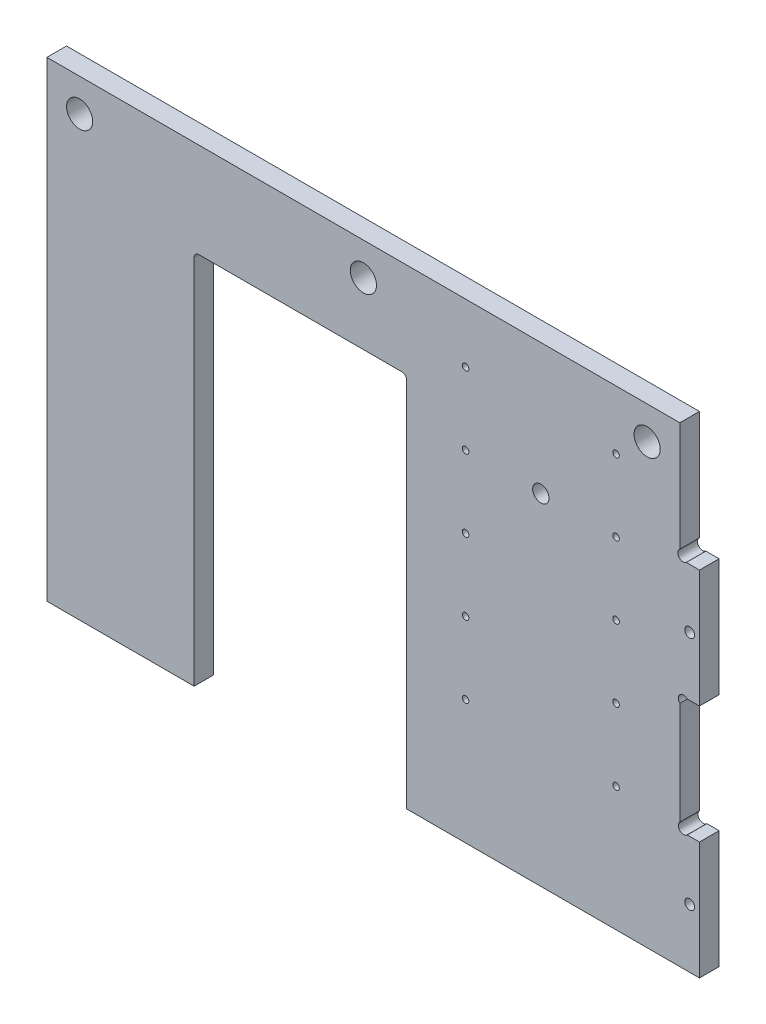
from build123d import *

# Parameters (mm, degrees)
EXTRUSION1_DEPTH        = 6
ESQUISSE2_R             = 1.6
ENL_V_MAT_EXTRU_1_DEPTH = 247.114302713
ESQUISSE3_R             = 4
ESQUISSE3_R_2           = 1
ESQUISSE3_R_3           = 1.5
ENL_V_MAT_EXTRU_2_DEPTH = 247.114302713
ESQUISSE4_R             = 2.5
ENL_V_MAT_EXTRU_3_DEPTH = 247.114302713


with BuildPart() as part:
    # Esquisse1 → Extrusion1 (new body)
    with BuildSketch(Plane.XY):
        Polygon((0, 0), (0, 144), (193.5, 144), (193.5, 108), (199.5, 108), (199.5, 72), (193.5, 72), (193.5, 36), (199.5, 36), (199.5, 0), align=None)
    extrude(amount=EXTRUSION1_DEPTH)

    # Esquisse2 → Enl_v. mat.-Extru.1 (cut, through all)
    with BuildSketch(Plane.XY.offset(6)):
        with Locations((194.483121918, 109.262327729)):
            Circle(ESQUISSE2_R)
        with Locations((194.63137085, 70.86862915)):
            Circle(ESQUISSE2_R)
        with Locations((194.63137085, 37.13137085)):
            Circle(ESQUISSE2_R)
    extrude(amount=-ENL_V_MAT_EXTRU_1_DEPTH, mode=Mode.SUBTRACT)

    # Esquisse3 → Enl_v. mat.-Extru.2 (cut, through all)
    with BuildSketch(Plane(origin=(0, 0, 0), x_dir=(-1, 0, 0), z_dir=(0, 0, -1))):
        with Locations((-10, 134)):
            Circle(ESQUISSE3_R)
        with Locations((-183.5, 134)):
            Circle(ESQUISSE3_R)
        with Locations((-174, 126)):
            Circle(ESQUISSE3_R_2)
        with Locations((-128, 126)):
            Circle(ESQUISSE3_R_2)
        with Locations((-174, 104)):
            Circle(ESQUISSE3_R_2)
        with Locations((-174, 82)):
            Circle(ESQUISSE3_R_2)
        with Locations((-174, 60)):
            Circle(ESQUISSE3_R_2)
        with Locations((-174, 38)):
            Circle(ESQUISSE3_R_2)
        with Locations((-128, 38)):
            Circle(ESQUISSE3_R_2)
        with Locations((-128, 60)):
            Circle(ESQUISSE3_R_2)
        with Locations((-128, 82)):
            Circle(ESQUISSE3_R_2)
        with Locations((-128, 104)):
            Circle(ESQUISSE3_R_2)
        with Locations((-96.75, 134)):
            Circle(ESQUISSE3_R)
        with Locations((-196.5, 90)):
            Circle(ESQUISSE3_R_3)
        with Locations((-196.5, 18)):
            Circle(ESQUISSE3_R_3)
        with BuildLine():
            Line((-108.5, 115), (-46.5, 115))
            ThreePointArc((-46.5, 115), (-45.439339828, 114.560660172), (-45, 113.5))
            Line((-45, 113.5), (-45, 0))
            Line((-45, 0), (-110, 0))
            Line((-110, 0), (-110, 113.5))
            ThreePointArc((-110, 113.5), (-109.560660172, 114.560660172), (-108.5, 115))
        make_face()
    extrude(amount=-ENL_V_MAT_EXTRU_2_DEPTH, mode=Mode.SUBTRACT)

    # Esquisse4 → Enl_v. mat.-Extru.3 (cut, through all)
    with BuildSketch(Plane.XY.offset(6)):
        with Locations((151, 104)):
            Circle(ESQUISSE4_R)
    extrude(amount=-ENL_V_MAT_EXTRU_3_DEPTH, mode=Mode.SUBTRACT)


solid = part.part
